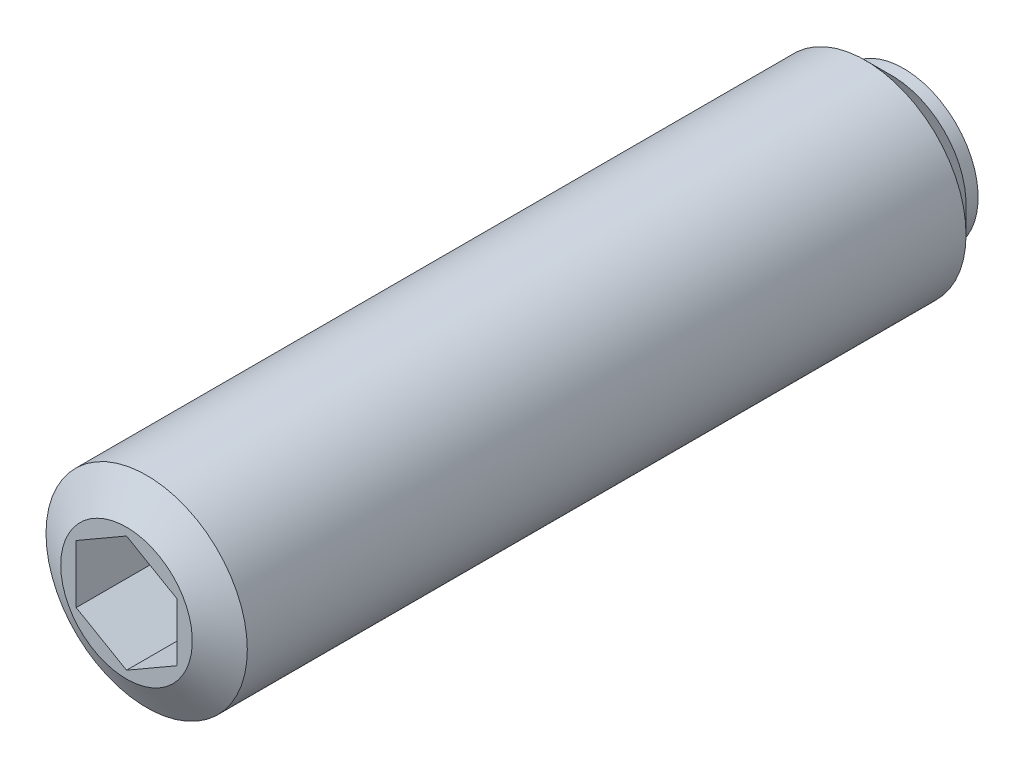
ISO-10303-21;
HEADER;
FILE_DESCRIPTION(('STEP AP214'),'2;1');
FILE_NAME('part.step','',(''),(''),'','','');
FILE_SCHEMA(('AUTOMOTIVE_DESIGN { 1 0 10303 214 1 1 1 1 }'));
ENDSEC;
DATA;
#1=APPLICATION_CONTEXT('core data for automotive mechanical design processes');
#2=APPLICATION_PROTOCOL_DEFINITION('international standard','automotive_design',2000,#1);
#3=PRODUCT_CONTEXT('',#1,'mechanical');
#4=PRODUCT('Part','Part','',(#3));
#5=PRODUCT_RELATED_PRODUCT_CATEGORY('part','',(#4));
#6=PRODUCT_DEFINITION_FORMATION('','',#4);
#7=PRODUCT_DEFINITION_CONTEXT('part definition',#1,'design');
#8=PRODUCT_DEFINITION('design','',#6,#7);
#9=PRODUCT_DEFINITION_SHAPE('','',#8);
#10=(LENGTH_UNIT() NAMED_UNIT(*) SI_UNIT(.MILLI.,.METRE.));
#11=(NAMED_UNIT(*) PLANE_ANGLE_UNIT() SI_UNIT($,.RADIAN.));
#12=(NAMED_UNIT(*) SI_UNIT($,.STERADIAN.) SOLID_ANGLE_UNIT());
#13=UNCERTAINTY_MEASURE_WITH_UNIT(LENGTH_MEASURE(1.E-05),#10,'distance_accuracy_value','');
#14=(GEOMETRIC_REPRESENTATION_CONTEXT(3) GLOBAL_UNCERTAINTY_ASSIGNED_CONTEXT((#13)) GLOBAL_UNIT_ASSIGNED_CONTEXT((#10,
#11,#12)) REPRESENTATION_CONTEXT('',''));
#15=CARTESIAN_POINT('',(0.,0.,0.));
#16=DIRECTION('',(0.,0.,1.));
#17=DIRECTION('',(1.,0.,0.));
#18=AXIS2_PLACEMENT_3D('',#15,#16,#17);
#19=CARTESIAN_POINT('',(0.,0.,1.5));
#20=DIRECTION('',(0.,0.,1.));
#21=DIRECTION('',(0.,-1.,0.));
#22=AXIS2_PLACEMENT_3D('',#19,#20,#21);
#23=SPHERICAL_SURFACE('',#22,1.5);
#24=CARTESIAN_POINT('',(0.,0.,0.7));
#25=DIRECTION('',(0.,0.,1.));
#26=DIRECTION('',(-1.,0.,0.));
#27=AXIS2_PLACEMENT_3D('',#24,#25,#26);
#28=CIRCLE('',#27,1.26885775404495);
#29=CARTESIAN_POINT('',(-1.26885775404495,0.,0.7));
#30=VERTEX_POINT('',#29);
#31=EDGE_CURVE('E9',#30,#30,#28,.T.);
#32=ORIENTED_EDGE('',*,*,#31,.F.);
#33=EDGE_LOOP('',(#32));
#34=FACE_BOUND('',#33,.T.);
#35=ADVANCED_FACE('F14',(#34),#23,.T.);
#36=CARTESIAN_POINT('',(0.,1.85,0.7));
#37=DIRECTION('',(0.,0.,1.));
#38=DIRECTION('',(-1.,0.,0.));
#39=AXIS2_PLACEMENT_3D('',#36,#37,#38);
#40=PLANE('',#39);
#41=CARTESIAN_POINT('',(0.,0.,0.7));
#42=DIRECTION('',(0.,0.,1.));
#43=DIRECTION('',(-1.,0.,0.));
#44=AXIS2_PLACEMENT_3D('',#41,#42,#43);
#45=CIRCLE('',#44,1.85);
#46=CARTESIAN_POINT('',(-1.85,0.,0.7));
#47=VERTEX_POINT('',#46);
#48=EDGE_CURVE('E21',#47,#47,#45,.T.);
#49=ORIENTED_EDGE('',*,*,#48,.F.);
#50=EDGE_LOOP('',(#49));
#51=FACE_BOUND('',#50,.T.);
#52=ORIENTED_EDGE('',*,*,#31,.T.);
#53=EDGE_LOOP('',(#52));
#54=FACE_BOUND('',#53,.T.);
#55=ADVANCED_FACE('F138',(#51,#54),#40,.F.);
#56=CARTESIAN_POINT('',(0.,0.,21.3950749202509));
#57=DIRECTION('',(0.,0.,1.));
#58=DIRECTION('',(-1.,0.,0.));
#59=AXIS2_PLACEMENT_3D('',#56,#57,#58);
#60=CYLINDRICAL_SURFACE('',#59,1.85);
#61=CARTESIAN_POINT('',(0.,0.,1.));
#62=DIRECTION('',(0.,0.,1.));
#63=DIRECTION('',(-1.,0.,0.));
#64=AXIS2_PLACEMENT_3D('',#61,#62,#63);
#65=CIRCLE('',#64,1.85);
#66=CARTESIAN_POINT('',(-1.85,0.,1.));
#67=VERTEX_POINT('',#66);
#68=EDGE_CURVE('E131',#67,#67,#65,.T.);
#69=ORIENTED_EDGE('',*,*,#68,.F.);
#70=EDGE_LOOP('',(#69));
#71=FACE_BOUND('',#70,.T.);
#72=ORIENTED_EDGE('',*,*,#48,.T.);
#73=EDGE_LOOP('',(#72));
#74=FACE_BOUND('',#73,.T.);
#75=ADVANCED_FACE('F136',(#71,#74),#60,.T.);
#76=CARTESIAN_POINT('',(0.,0.,1.));
#77=DIRECTION('',(0.,0.,1.));
#78=DIRECTION('',(-1.,0.,0.));
#79=AXIS2_PLACEMENT_3D('',#76,#77,#78);
#80=CONICAL_SURFACE('',#79,1.85,0.785398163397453);
#81=CARTESIAN_POINT('',(0.,0.,1.65));
#82=DIRECTION('',(0.,0.,1.));
#83=DIRECTION('',(-1.,0.,0.));
#84=AXIS2_PLACEMENT_3D('',#81,#82,#83);
#85=CIRCLE('',#84,2.5);
#86=CARTESIAN_POINT('',(-2.5,0.,1.65));
#87=VERTEX_POINT('',#86);
#88=EDGE_CURVE('E128',#87,#87,#85,.T.);
#89=ORIENTED_EDGE('',*,*,#88,.F.);
#90=EDGE_LOOP('',(#89));
#91=FACE_BOUND('',#90,.T.);
#92=ORIENTED_EDGE('',*,*,#68,.T.);
#93=EDGE_LOOP('',(#92));
#94=FACE_BOUND('',#93,.T.);
#95=ADVANCED_FACE('F161',(#91,#94),#80,.T.);
#96=CARTESIAN_POINT('',(0.,0.,21.3950749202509));
#97=DIRECTION('',(0.,0.,1.));
#98=DIRECTION('',(-1.,0.,0.));
#99=AXIS2_PLACEMENT_3D('',#96,#97,#98);
#100=CYLINDRICAL_SURFACE('',#99,2.5);
#101=CARTESIAN_POINT('',(0.,0.,19.5));
#102=DIRECTION('',(0.,0.,1.));
#103=DIRECTION('',(-1.,0.,0.));
#104=AXIS2_PLACEMENT_3D('',#101,#102,#103);
#105=CIRCLE('',#104,2.5);
#106=CARTESIAN_POINT('',(-2.5,0.,19.5));
#107=VERTEX_POINT('',#106);
#108=EDGE_CURVE('E125',#107,#107,#105,.T.);
#109=ORIENTED_EDGE('',*,*,#108,.F.);
#110=EDGE_LOOP('',(#109));
#111=FACE_BOUND('',#110,.T.);
#112=ORIENTED_EDGE('',*,*,#88,.T.);
#113=EDGE_LOOP('',(#112));
#114=FACE_BOUND('',#113,.T.);
#115=ADVANCED_FACE('F170',(#111,#114),#100,.T.);
#116=CARTESIAN_POINT('',(0.,0.,19.5));
#117=DIRECTION('',(0.,0.,-1.));
#118=DIRECTION('',(1.,0.,0.));
#119=AXIS2_PLACEMENT_3D('',#116,#117,#118);
#120=CONICAL_SURFACE('',#119,2.5,1.04719755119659);
#121=CARTESIAN_POINT('',(0.,0.,20.));
#122=DIRECTION('',(0.,0.,1.));
#123=DIRECTION('',(-1.,0.,0.));
#124=AXIS2_PLACEMENT_3D('',#121,#122,#123);
#125=CIRCLE('',#124,1.63397459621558);
#126=CARTESIAN_POINT('',(-1.63397459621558,0.,20.));
#127=VERTEX_POINT('',#126);
#128=EDGE_CURVE('E116',#127,#127,#125,.T.);
#129=ORIENTED_EDGE('',*,*,#128,.F.);
#130=EDGE_LOOP('',(#129));
#131=FACE_BOUND('',#130,.T.);
#132=ORIENTED_EDGE('',*,*,#108,.T.);
#133=EDGE_LOOP('',(#132));
#134=FACE_BOUND('',#133,.T.);
#135=ADVANCED_FACE('F179',(#131,#134),#120,.T.);
#136=CARTESIAN_POINT('',(0.,0.,20.));
#137=DIRECTION('',(0.,0.,-1.));
#138=DIRECTION('',(1.,0.,0.));
#139=AXIS2_PLACEMENT_3D('',#136,#137,#138);
#140=PLANE('',#139);
#141=DIRECTION('',(-0.866025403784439,-0.5,0.));
#142=VECTOR('',#141,1.);
#143=CARTESIAN_POINT('',(0.,1.44337567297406,20.));
#144=LINE('',#143,#142);
#145=CARTESIAN_POINT('',(0.,1.44337567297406,20.));
#146=VERTEX_POINT('',#145);
#147=CARTESIAN_POINT('',(-1.25,0.721687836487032,20.));
#148=VERTEX_POINT('',#147);
#149=EDGE_CURVE('E82',#146,#148,#144,.T.);
#150=ORIENTED_EDGE('',*,*,#149,.F.);
#151=DIRECTION('',(-0.866025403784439,0.5,0.));
#152=VECTOR('',#151,1.);
#153=CARTESIAN_POINT('',(1.25,0.721687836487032,20.));
#154=LINE('',#153,#152);
#155=CARTESIAN_POINT('',(1.25,0.721687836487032,20.));
#156=VERTEX_POINT('',#155);
#157=EDGE_CURVE('E28',#156,#146,#154,.T.);
#158=ORIENTED_EDGE('',*,*,#157,.F.);
#159=DIRECTION('',(0.,1.,0.));
#160=VECTOR('',#159,1.);
#161=CARTESIAN_POINT('',(1.25,-0.721687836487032,20.));
#162=LINE('',#161,#160);
#163=CARTESIAN_POINT('',(1.25,-0.721687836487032,20.));
#164=VERTEX_POINT('',#163);
#165=EDGE_CURVE('E98',#164,#156,#162,.T.);
#166=ORIENTED_EDGE('',*,*,#165,.F.);
#167=DIRECTION('',(0.866025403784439,0.5,0.));
#168=VECTOR('',#167,1.);
#169=CARTESIAN_POINT('',(0.,-1.44337567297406,20.));
#170=LINE('',#169,#168);
#171=CARTESIAN_POINT('',(0.,-1.44337567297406,20.));
#172=VERTEX_POINT('',#171);
#173=EDGE_CURVE('E92',#172,#164,#170,.T.);
#174=ORIENTED_EDGE('',*,*,#173,.F.);
#175=DIRECTION('',(0.866025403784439,-0.5,0.));
#176=VECTOR('',#175,1.);
#177=CARTESIAN_POINT('',(-1.25,-0.721687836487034,20.));
#178=LINE('',#177,#176);
#179=CARTESIAN_POINT('',(-1.25,-0.721687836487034,20.));
#180=VERTEX_POINT('',#179);
#181=EDGE_CURVE('E90',#180,#172,#178,.T.);
#182=ORIENTED_EDGE('',*,*,#181,.F.);
#183=DIRECTION('',(0.,-1.,0.));
#184=VECTOR('',#183,1.);
#185=CARTESIAN_POINT('',(-1.25,0.721687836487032,20.));
#186=LINE('',#185,#184);
#187=EDGE_CURVE('E71',#148,#180,#186,.T.);
#188=ORIENTED_EDGE('',*,*,#187,.F.);
#189=EDGE_LOOP('',(#150,#158,#166,#174,#182,#188));
#190=FACE_BOUND('',#189,.T.);
#191=ORIENTED_EDGE('',*,*,#128,.T.);
#192=EDGE_LOOP('',(#191));
#193=FACE_BOUND('',#192,.T.);
#194=ADVANCED_FACE('F86',(#190,#193),#140,.F.);
#195=CARTESIAN_POINT('',(1.25,0.721687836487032,17.));
#196=DIRECTION('',(0.5,0.866025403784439,0.));
#197=DIRECTION('',(0.866025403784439,-0.5,0.));
#198=AXIS2_PLACEMENT_3D('',#195,#196,#197);
#199=PLANE('',#198);
#200=ORIENTED_EDGE('',*,*,#157,.T.);
#201=DIRECTION('',(0.,0.,1.));
#202=VECTOR('',#201,1.);
#203=CARTESIAN_POINT('',(0.,1.44337567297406,17.));
#204=LINE('',#203,#202);
#205=CARTESIAN_POINT('',(0.,1.44337567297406,17.));
#206=VERTEX_POINT('',#205);
#207=EDGE_CURVE('E79',#206,#146,#204,.T.);
#208=ORIENTED_EDGE('',*,*,#207,.F.);
#209=DIRECTION('',(-0.866025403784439,0.5,0.));
#210=VECTOR('',#209,1.);
#211=CARTESIAN_POINT('',(1.25,0.721687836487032,17.));
#212=LINE('',#211,#210);
#213=CARTESIAN_POINT('',(1.25,0.721687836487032,17.));
#214=VERTEX_POINT('',#213);
#215=EDGE_CURVE('E100',#214,#206,#212,.T.);
#216=ORIENTED_EDGE('',*,*,#215,.F.);
#217=DIRECTION('',(0.,0.,1.));
#218=VECTOR('',#217,1.);
#219=CARTESIAN_POINT('',(1.25,0.721687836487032,17.));
#220=LINE('',#219,#218);
#221=EDGE_CURVE('E35',#214,#156,#220,.T.);
#222=ORIENTED_EDGE('',*,*,#221,.T.);
#223=EDGE_LOOP('',(#200,#208,#216,#222));
#224=FACE_BOUND('',#223,.T.);
#225=ADVANCED_FACE('F196',(#224),#199,.F.);
#226=CARTESIAN_POINT('',(1.25,-0.721687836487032,17.));
#227=DIRECTION('',(1.,0.,0.));
#228=DIRECTION('',(0.,-1.,0.));
#229=AXIS2_PLACEMENT_3D('',#226,#227,#228);
#230=PLANE('',#229);
#231=ORIENTED_EDGE('',*,*,#165,.T.);
#232=ORIENTED_EDGE('',*,*,#221,.F.);
#233=DIRECTION('',(0.,1.,0.));
#234=VECTOR('',#233,1.);
#235=CARTESIAN_POINT('',(1.25,-0.721687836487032,17.));
#236=LINE('',#235,#234);
#237=CARTESIAN_POINT('',(1.25,-0.721687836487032,17.));
#238=VERTEX_POINT('',#237);
#239=EDGE_CURVE('E112',#238,#214,#236,.T.);
#240=ORIENTED_EDGE('',*,*,#239,.F.);
#241=DIRECTION('',(0.,0.,1.));
#242=VECTOR('',#241,1.);
#243=CARTESIAN_POINT('',(1.25,-0.721687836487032,17.));
#244=LINE('',#243,#242);
#245=EDGE_CURVE('E117',#238,#164,#244,.T.);
#246=ORIENTED_EDGE('',*,*,#245,.T.);
#247=EDGE_LOOP('',(#231,#232,#240,#246));
#248=FACE_BOUND('',#247,.T.);
#249=ADVANCED_FACE('F204',(#248),#230,.F.);
#250=CARTESIAN_POINT('',(0.,-1.44337567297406,17.));
#251=DIRECTION('',(0.5,-0.866025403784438,0.));
#252=DIRECTION('',(-0.866025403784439,-0.5,0.));
#253=AXIS2_PLACEMENT_3D('',#250,#251,#252);
#254=PLANE('',#253);
#255=ORIENTED_EDGE('',*,*,#173,.T.);
#256=ORIENTED_EDGE('',*,*,#245,.F.);
#257=DIRECTION('',(0.866025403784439,0.5,0.));
#258=VECTOR('',#257,1.);
#259=CARTESIAN_POINT('',(0.,-1.44337567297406,17.));
#260=LINE('',#259,#258);
#261=CARTESIAN_POINT('',(0.,-1.44337567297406,17.));
#262=VERTEX_POINT('',#261);
#263=EDGE_CURVE('E109',#262,#238,#260,.T.);
#264=ORIENTED_EDGE('',*,*,#263,.F.);
#265=DIRECTION('',(0.,0.,1.));
#266=VECTOR('',#265,1.);
#267=CARTESIAN_POINT('',(0.,-1.44337567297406,17.));
#268=LINE('',#267,#266);
#269=EDGE_CURVE('E119',#262,#172,#268,.T.);
#270=ORIENTED_EDGE('',*,*,#269,.T.);
#271=EDGE_LOOP('',(#255,#256,#264,#270));
#272=FACE_BOUND('',#271,.T.);
#273=ADVANCED_FACE('F212',(#272),#254,.F.);
#274=CARTESIAN_POINT('',(-1.25,-0.721687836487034,17.));
#275=DIRECTION('',(-0.5,-0.866025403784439,0.));
#276=DIRECTION('',(-0.866025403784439,0.5,0.));
#277=AXIS2_PLACEMENT_3D('',#274,#275,#276);
#278=PLANE('',#277);
#279=ORIENTED_EDGE('',*,*,#181,.T.);
#280=ORIENTED_EDGE('',*,*,#269,.F.);
#281=DIRECTION('',(0.866025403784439,-0.5,0.));
#282=VECTOR('',#281,1.);
#283=CARTESIAN_POINT('',(-1.25,-0.721687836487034,17.));
#284=LINE('',#283,#282);
#285=CARTESIAN_POINT('',(-1.25,-0.721687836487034,17.));
#286=VERTEX_POINT('',#285);
#287=EDGE_CURVE('E106',#286,#262,#284,.T.);
#288=ORIENTED_EDGE('',*,*,#287,.F.);
#289=DIRECTION('',(0.,0.,1.));
#290=VECTOR('',#289,1.);
#291=CARTESIAN_POINT('',(-1.25,-0.721687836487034,17.));
#292=LINE('',#291,#290);
#293=EDGE_CURVE('E78',#286,#180,#292,.T.);
#294=ORIENTED_EDGE('',*,*,#293,.T.);
#295=EDGE_LOOP('',(#279,#280,#288,#294));
#296=FACE_BOUND('',#295,.T.);
#297=ADVANCED_FACE('F220',(#296),#278,.F.);
#298=CARTESIAN_POINT('',(-1.25,0.721687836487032,17.));
#299=DIRECTION('',(-1.,0.,0.));
#300=DIRECTION('',(0.,1.,0.));
#301=AXIS2_PLACEMENT_3D('',#298,#299,#300);
#302=PLANE('',#301);
#303=ORIENTED_EDGE('',*,*,#187,.T.);
#304=ORIENTED_EDGE('',*,*,#293,.F.);
#305=DIRECTION('',(0.,-1.,0.));
#306=VECTOR('',#305,1.);
#307=CARTESIAN_POINT('',(-1.25,0.721687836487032,17.));
#308=LINE('',#307,#306);
#309=CARTESIAN_POINT('',(-1.25,0.721687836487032,17.));
#310=VERTEX_POINT('',#309);
#311=EDGE_CURVE('E74',#310,#286,#308,.T.);
#312=ORIENTED_EDGE('',*,*,#311,.F.);
#313=DIRECTION('',(0.,0.,1.));
#314=VECTOR('',#313,1.);
#315=CARTESIAN_POINT('',(-1.25,0.721687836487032,17.));
#316=LINE('',#315,#314);
#317=EDGE_CURVE('E67',#310,#148,#316,.T.);
#318=ORIENTED_EDGE('',*,*,#317,.T.);
#319=EDGE_LOOP('',(#303,#304,#312,#318));
#320=FACE_BOUND('',#319,.T.);
#321=ADVANCED_FACE('F69',(#320),#302,.F.);
#322=CARTESIAN_POINT('',(0.,1.44337567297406,17.));
#323=DIRECTION('',(-0.5,0.866025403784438,0.));
#324=DIRECTION('',(0.866025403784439,0.5,0.));
#325=AXIS2_PLACEMENT_3D('',#322,#323,#324);
#326=PLANE('',#325);
#327=ORIENTED_EDGE('',*,*,#149,.T.);
#328=ORIENTED_EDGE('',*,*,#317,.F.);
#329=DIRECTION('',(-0.866025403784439,-0.5,0.));
#330=VECTOR('',#329,1.);
#331=CARTESIAN_POINT('',(0.,1.44337567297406,17.));
#332=LINE('',#331,#330);
#333=EDGE_CURVE('E103',#206,#310,#332,.T.);
#334=ORIENTED_EDGE('',*,*,#333,.F.);
#335=ORIENTED_EDGE('',*,*,#207,.T.);
#336=EDGE_LOOP('',(#327,#328,#334,#335));
#337=FACE_BOUND('',#336,.T.);
#338=ADVANCED_FACE('F83',(#337),#326,.F.);
#339=CARTESIAN_POINT('',(2.5,0.,17.));
#340=DIRECTION('',(0.,0.,-1.));
#341=DIRECTION('',(1.,0.,0.));
#342=AXIS2_PLACEMENT_3D('',#339,#340,#341);
#343=PLANE('',#342);
#344=ORIENTED_EDGE('',*,*,#215,.T.);
#345=ORIENTED_EDGE('',*,*,#333,.T.);
#346=ORIENTED_EDGE('',*,*,#311,.T.);
#347=ORIENTED_EDGE('',*,*,#287,.T.);
#348=ORIENTED_EDGE('',*,*,#263,.T.);
#349=ORIENTED_EDGE('',*,*,#239,.T.);
#350=EDGE_LOOP('',(#344,#345,#346,#347,#348,#349));
#351=FACE_BOUND('',#350,.T.);
#352=ADVANCED_FACE('F244',(#351),#343,.F.);
#353=CLOSED_SHELL('',(#35,#55,#75,#95,#115,#135,#194,#225,#249,#273,#297,#321,#338,#352));
#354=MANIFOLD_SOLID_BREP('B1',#353);
#355=ADVANCED_BREP_SHAPE_REPRESENTATION('',(#18,#354),#14);
#356=SHAPE_DEFINITION_REPRESENTATION(#9,#355);
ENDSEC;
END-ISO-10303-21;
